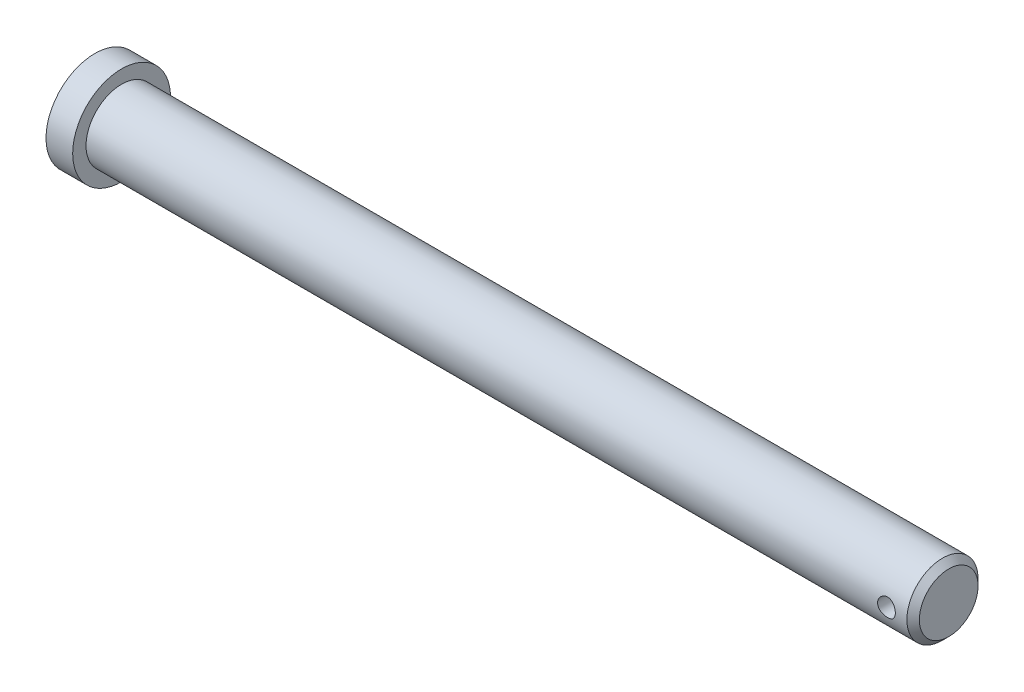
ISO-10303-21;
HEADER;
FILE_DESCRIPTION(('STEP AP214'),'2;1');
FILE_NAME('part.step','',(''),(''),'','','');
FILE_SCHEMA(('AUTOMOTIVE_DESIGN { 1 0 10303 214 1 1 1 1 }'));
ENDSEC;
DATA;
#1=APPLICATION_CONTEXT('core data for automotive mechanical design processes');
#2=APPLICATION_PROTOCOL_DEFINITION('international standard','automotive_design',2000,#1);
#3=PRODUCT_CONTEXT('',#1,'mechanical');
#4=PRODUCT('Part','Part','',(#3));
#5=PRODUCT_RELATED_PRODUCT_CATEGORY('part','',(#4));
#6=PRODUCT_DEFINITION_FORMATION('','',#4);
#7=PRODUCT_DEFINITION_CONTEXT('part definition',#1,'design');
#8=PRODUCT_DEFINITION('design','',#6,#7);
#9=PRODUCT_DEFINITION_SHAPE('','',#8);
#10=(LENGTH_UNIT() NAMED_UNIT(*) SI_UNIT(.MILLI.,.METRE.));
#11=(NAMED_UNIT(*) PLANE_ANGLE_UNIT() SI_UNIT($,.RADIAN.));
#12=(NAMED_UNIT(*) SI_UNIT($,.STERADIAN.) SOLID_ANGLE_UNIT());
#13=UNCERTAINTY_MEASURE_WITH_UNIT(LENGTH_MEASURE(1.E-05),#10,'distance_accuracy_value','');
#14=(GEOMETRIC_REPRESENTATION_CONTEXT(3) GLOBAL_UNCERTAINTY_ASSIGNED_CONTEXT((#13)) GLOBAL_UNIT_ASSIGNED_CONTEXT((#10,
#11,#12)) REPRESENTATION_CONTEXT('',''));
#15=CARTESIAN_POINT('',(0.,0.,0.));
#16=DIRECTION('',(0.,0.,1.));
#17=DIRECTION('',(1.,0.,0.));
#18=AXIS2_PLACEMENT_3D('',#15,#16,#17);
#19=CARTESIAN_POINT('',(0.,0.,0.));
#20=DIRECTION('',(-1.,0.,0.));
#21=DIRECTION('',(0.,0.,0.999999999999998));
#22=AXIS2_PLACEMENT_3D('',#19,#20,#21);
#23=PLANE('',#22);
#24=CARTESIAN_POINT('',(0.,0.,0.));
#25=DIRECTION('',(-1.,0.,0.));
#26=DIRECTION('',(0.,0.,0.999999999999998));
#27=AXIS2_PLACEMENT_3D('',#24,#25,#26);
#28=CIRCLE('',#27,3.30000000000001);
#29=CARTESIAN_POINT('',(0.,0.,3.3));
#30=VERTEX_POINT('',#29);
#31=EDGE_CURVE('E10',#30,#30,#28,.F.);
#32=ORIENTED_EDGE('',*,*,#31,.T.);
#33=EDGE_LOOP('',(#32));
#34=FACE_BOUND('',#33,.T.);
#35=ADVANCED_FACE('F34',(#34),#23,.F.);
#36=CARTESIAN_POINT('',(-96.0000000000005,1.11022302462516E-12,-8.88178419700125E-13));
#37=DIRECTION('',(-1.,0.,0.));
#38=DIRECTION('',(0.,0.,0.999999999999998));
#39=AXIS2_PLACEMENT_3D('',#36,#37,#38);
#40=CYLINDRICAL_SURFACE('',#39,3.99999999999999);
#41=CARTESIAN_POINT('',(-0.699999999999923,1.33226762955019E-12,-2.22044604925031E-12));
#42=DIRECTION('',(-1.,0.,0.));
#43=DIRECTION('',(0.,0.,0.999999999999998));
#44=AXIS2_PLACEMENT_3D('',#41,#42,#43);
#45=CIRCLE('',#44,3.99999999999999);
#46=CARTESIAN_POINT('',(-0.699999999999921,1.35658151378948E-12,3.99999999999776));
#47=VERTEX_POINT('',#46);
#48=EDGE_CURVE('E41',#47,#47,#45,.T.);
#49=ORIENTED_EDGE('',*,*,#48,.T.);
#50=EDGE_LOOP('',(#49));
#51=FACE_BOUND('',#50,.T.);
#52=CARTESIAN_POINT('',(-1.99999999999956,2.22044604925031E-12,3.99999999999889));
#53=CARTESIAN_POINT('',(-2.00000155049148,-0.0552507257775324,3.99999906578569));
#54=CARTESIAN_POINT('',(-2.00459436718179,-0.110518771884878,3.99884385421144));
#55=CARTESIAN_POINT('',(-2.02281676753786,-0.219470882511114,3.99434742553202));
#56=CARTESIAN_POINT('',(-2.0364514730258,-0.273154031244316,3.99100496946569));
#57=CARTESIAN_POINT('',(-2.07229283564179,-0.377347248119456,3.98250417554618));
#58=CARTESIAN_POINT('',(-2.09448919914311,-0.427861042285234,3.97734801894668));
#59=CARTESIAN_POINT('',(-2.14678759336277,-0.524448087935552,3.96576895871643));
#60=CARTESIAN_POINT('',(-2.17688989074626,-0.570521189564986,3.95934601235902));
#61=CARTESIAN_POINT('',(-2.24480052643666,-0.657867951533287,3.94578275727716));
#62=CARTESIAN_POINT('',(-2.28274104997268,-0.69903712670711,3.93863138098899));
#63=CARTESIAN_POINT('',(-2.36496813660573,-0.774499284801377,3.92449080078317));
#64=CARTESIAN_POINT('',(-2.40925541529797,-0.808791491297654,3.91750161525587));
#65=CARTESIAN_POINT('',(-2.50373015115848,-0.870017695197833,3.90436517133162));
#66=CARTESIAN_POINT('',(-2.55399548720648,-0.896834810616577,3.89823196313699));
#67=CARTESIAN_POINT('',(-2.65849894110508,-0.9415979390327,3.88766329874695));
#68=CARTESIAN_POINT('',(-2.71273642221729,-0.959545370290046,3.88322757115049));
#69=CARTESIAN_POINT('',(-2.82249566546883,-0.985703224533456,3.87666984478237));
#70=CARTESIAN_POINT('',(-2.87796993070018,-0.994101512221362,3.87450327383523));
#71=CARTESIAN_POINT('',(-2.98957904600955,-1.00150785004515,3.87259575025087));
#72=CARTESIAN_POINT('',(-3.04571378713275,-1.00051742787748,3.87285440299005));
#73=CARTESIAN_POINT('',(-3.1556105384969,-0.98932434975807,3.87572803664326));
#74=CARTESIAN_POINT('',(-3.20939708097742,-0.979345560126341,3.8782857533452));
#75=CARTESIAN_POINT('',(-3.31450736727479,-0.950816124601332,3.885378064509));
#76=CARTESIAN_POINT('',(-3.36583093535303,-0.932264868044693,3.88991279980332));
#77=CARTESIAN_POINT('',(-3.4651586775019,-0.886926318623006,3.90050075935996));
#78=CARTESIAN_POINT('',(-3.51312411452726,-0.860057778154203,3.90656884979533));
#79=CARTESIAN_POINT('',(-3.60394580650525,-0.798904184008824,3.91953140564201));
#80=CARTESIAN_POINT('',(-3.64680116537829,-0.764617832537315,3.92642601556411));
#81=CARTESIAN_POINT('',(-3.72746907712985,-0.688442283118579,3.94050587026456));
#82=CARTESIAN_POINT('',(-3.76510299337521,-0.6463641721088,3.94769379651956));
#83=CARTESIAN_POINT('',(-3.83281416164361,-0.556407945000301,3.96137310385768));
#84=CARTESIAN_POINT('',(-3.86289118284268,-0.508529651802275,3.96786446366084));
#85=CARTESIAN_POINT('',(-3.91470039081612,-0.408077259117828,3.97945154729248));
#86=CARTESIAN_POINT('',(-3.93640356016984,-0.355487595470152,3.98454240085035));
#87=CARTESIAN_POINT('',(-3.97061153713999,-0.247250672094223,3.99271944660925));
#88=CARTESIAN_POINT('',(-3.98311810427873,-0.191603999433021,3.99580602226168));
#89=CARTESIAN_POINT('',(-3.99830504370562,-0.0803599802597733,3.99956999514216));
#90=CARTESIAN_POINT('',(-4.00122868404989,-0.0247978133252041,4.00030702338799));
#91=CARTESIAN_POINT('',(-3.99783399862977,0.086021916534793,3.99945869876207));
#92=CARTESIAN_POINT('',(-3.9915165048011,0.141279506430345,3.99787355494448));
#93=CARTESIAN_POINT('',(-3.97001939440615,0.249076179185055,3.99259720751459));
#94=CARTESIAN_POINT('',(-3.95497249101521,0.301643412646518,3.98893756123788));
#95=CARTESIAN_POINT('',(-3.91659527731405,0.403504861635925,3.97992471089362));
#96=CARTESIAN_POINT('',(-3.89326413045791,0.452798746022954,3.97457133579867));
#97=CARTESIAN_POINT('',(-3.83850924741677,0.547682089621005,3.96262205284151));
#98=CARTESIAN_POINT('',(-3.80694925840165,0.593190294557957,3.95600578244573));
#99=CARTESIAN_POINT('',(-3.73680672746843,0.678351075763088,3.94229672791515));
#100=CARTESIAN_POINT('',(-3.69822297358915,0.718002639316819,3.93520386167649));
#101=CARTESIAN_POINT('',(-3.61399869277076,0.791327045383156,3.92112637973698));
#102=CARTESIAN_POINT('',(-3.56820819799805,0.824829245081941,3.91414869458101));
#103=CARTESIAN_POINT('',(-3.47151157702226,0.883673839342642,3.90128585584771));
#104=CARTESIAN_POINT('',(-3.42060567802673,0.909016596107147,3.8954006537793));
#105=CARTESIAN_POINT('',(-3.31539618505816,0.950634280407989,3.88545396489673));
#106=CARTESIAN_POINT('',(-3.2611149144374,0.966962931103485,3.88138170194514));
#107=CARTESIAN_POINT('',(-3.15046024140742,0.990230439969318,3.87551162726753));
#108=CARTESIAN_POINT('',(-3.09408729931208,0.997171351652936,3.87371331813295));
#109=CARTESIAN_POINT('',(-2.98258598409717,1.00135906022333,3.87263267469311));
#110=CARTESIAN_POINT('',(-2.92746837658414,0.998878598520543,3.87327955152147));
#111=CARTESIAN_POINT('',(-2.8184640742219,0.98491818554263,3.8768527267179));
#112=CARTESIAN_POINT('',(-2.76457735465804,0.973438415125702,3.87977897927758));
#113=CARTESIAN_POINT('',(-2.65986102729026,0.941954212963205,3.88754173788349));
#114=CARTESIAN_POINT('',(-2.60901512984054,0.922000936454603,3.89236676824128));
#115=CARTESIAN_POINT('',(-2.51135641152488,0.874176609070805,3.90338503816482));
#116=CARTESIAN_POINT('',(-2.46454415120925,0.846304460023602,3.90957846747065));
#117=CARTESIAN_POINT('',(-2.37496358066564,0.782578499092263,3.92283756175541));
#118=CARTESIAN_POINT('',(-2.33233261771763,0.746535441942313,3.92992176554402));
#119=CARTESIAN_POINT('',(-2.25363530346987,0.667859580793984,3.94405351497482));
#120=CARTESIAN_POINT('',(-2.2175705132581,0.625225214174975,3.9511010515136));
#121=CARTESIAN_POINT('',(-2.15239246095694,0.533645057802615,3.96451770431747));
#122=CARTESIAN_POINT('',(-2.12341692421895,0.484598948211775,3.97087222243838));
#123=CARTESIAN_POINT('',(-2.07416835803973,0.382177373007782,3.98203283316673));
#124=CARTESIAN_POINT('',(-2.05388909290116,0.328805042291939,3.98684003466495));
#125=CARTESIAN_POINT('',(-2.02561877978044,0.229606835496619,3.9936537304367));
#126=CARTESIAN_POINT('',(-2.01603250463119,0.184253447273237,3.99601723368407));
#127=CARTESIAN_POINT('',(-2.00322270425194,0.0926040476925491,3.99919070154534));
#128=CARTESIAN_POINT('',(-1.99999870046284,0.046308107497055,4.00000078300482));
#129=CARTESIAN_POINT('',(-1.99999999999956,2.22044604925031E-12,3.99999999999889));
#130=B_SPLINE_CURVE_WITH_KNOTS('',3,(#52,#53,#54,#55,#56,#57,#58,#59,#60,#61,#62,#63,#64,#65,
#66,#67,#68,#69,#70,#71,#72,#73,#74,#75,#76,#77,#78,#79,#80,#81,#82,#83,#84,#85,#86,#87,#88,#89,
#90,#91,#92,#93,#94,#95,#96,#97,#98,#99,#100,#101,#102,#103,#104,#105,#106,#107,#108,#109,#110,
#111,#112,#113,#114,#115,#116,#117,#118,#119,#120,#121,#122,#123,#124,#125,#126,#127,#128,#129),
.UNSPECIFIED.,.T.,.F.,(4,2,2,2,2,2,2,2,2,2,2,2,2,2,2,2,2,2,2,2,2,2,2,2,2,2,2,2,2,2,2,2,2,2,2,2,
2,2,4),(0.,0.165582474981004,0.331258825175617,0.49673660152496,0.662219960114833,
0.830762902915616,0.999324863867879,1.17039098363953,1.34142974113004,1.50904196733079,
1.67662692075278,1.84014998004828,2.00368468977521,2.16887018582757,2.33408460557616,
2.50401000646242,2.67394059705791,2.84445486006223,3.01493649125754,3.1810553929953,
3.347159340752,3.51080183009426,3.67446084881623,3.84102391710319,4.00761575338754,
4.17829672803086,4.34897012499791,4.5186150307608,4.68822282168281,4.85295853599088,
5.01769093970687,5.18144267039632,5.34521712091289,5.51326384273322,5.68135046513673,
5.85248123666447,6.02348909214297,6.16228161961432,6.30106370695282),.UNSPECIFIED.);
#131=CARTESIAN_POINT('',(-1.99999999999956,2.22044604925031E-12,3.99999999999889));
#132=VERTEX_POINT('',#131);
#133=EDGE_CURVE('E52',#132,#132,#130,.T.);
#134=ORIENTED_EDGE('',*,*,#133,.T.);
#135=EDGE_LOOP('',(#134));
#136=FACE_BOUND('',#135,.T.);
#137=CARTESIAN_POINT('',(-2.00000000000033,1.11022302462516E-12,-4.00000000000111));
#138=CARTESIAN_POINT('',(-2.00000155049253,0.0552507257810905,-3.99999906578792));
#139=CARTESIAN_POINT('',(-2.00459436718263,0.110518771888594,-3.99884385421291));
#140=CARTESIAN_POINT('',(-2.02281676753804,0.21947088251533,-3.99434742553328));
#141=CARTESIAN_POINT('',(-2.03645147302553,0.273154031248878,-3.9910049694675));
#142=CARTESIAN_POINT('',(-2.07229283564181,0.377347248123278,-3.98250417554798));
#143=CARTESIAN_POINT('',(-2.09448919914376,0.427861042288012,-3.97734801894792));
#144=CARTESIAN_POINT('',(-2.14678759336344,0.524448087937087,-3.96576895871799));
#145=CARTESIAN_POINT('',(-2.17688989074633,0.570521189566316,-3.95934601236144));
#146=CARTESIAN_POINT('',(-2.24480052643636,0.657867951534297,-3.94578275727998));
#147=CARTESIAN_POINT('',(-2.2827410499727,0.699037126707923,-3.93863138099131));
#148=CARTESIAN_POINT('',(-2.36496813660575,0.774499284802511,-3.92449080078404));
#149=CARTESIAN_POINT('',(-2.40925541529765,0.808791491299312,-3.91750161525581));
#150=CARTESIAN_POINT('',(-2.50373015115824,0.870017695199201,-3.9043651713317));
#151=CARTESIAN_POINT('',(-2.55399548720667,0.896834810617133,-3.89823196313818));
#152=CARTESIAN_POINT('',(-2.65849894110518,0.941597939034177,-3.88766329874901));
#153=CARTESIAN_POINT('',(-2.71273642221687,0.959545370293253,-3.88322757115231));
#154=CARTESIAN_POINT('',(-2.82249566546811,0.98570322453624,-3.8766698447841));
#155=CARTESIAN_POINT('',(-2.87796993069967,0.994101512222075,-3.87450327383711));
#156=CARTESIAN_POINT('',(-2.98957904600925,1.00150785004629,-3.87259575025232));
#157=CARTESIAN_POINT('',(-3.04571378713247,1.00051742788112,-3.87285440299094));
#158=CARTESIAN_POINT('',(-3.15561053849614,0.989324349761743,-3.87572803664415));
#159=CARTESIAN_POINT('',(-3.2093970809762,0.979345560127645,-3.87828575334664));
#160=CARTESIAN_POINT('',(-3.31450736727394,0.950816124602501,-3.88537806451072));
#161=CARTESIAN_POINT('',(-3.36583093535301,0.932264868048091,-3.88991279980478));
#162=CARTESIAN_POINT('',(-3.46515867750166,0.886926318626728,-3.90050075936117));
#163=CARTESIAN_POINT('',(-3.51312411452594,0.860057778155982,-3.90656884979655));
#164=CARTESIAN_POINT('',(-3.60394580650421,0.798904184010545,-3.9195314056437));
#165=CARTESIAN_POINT('',(-3.6468011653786,0.764617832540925,-3.92642601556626));
#166=CARTESIAN_POINT('',(-3.72746907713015,0.688442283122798,-3.94050587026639));
#167=CARTESIAN_POINT('',(-3.76510299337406,0.646364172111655,-3.94769379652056));
#168=CARTESIAN_POINT('',(-3.83281416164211,0.556407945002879,-3.9613731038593));
#169=CARTESIAN_POINT('',(-3.86289118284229,0.508529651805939,-3.9678644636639));
#170=CARTESIAN_POINT('',(-3.91470039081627,0.40807725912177,-3.97945154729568));
#171=CARTESIAN_POINT('',(-3.93640356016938,0.355487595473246,-3.98454240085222));
#172=CARTESIAN_POINT('',(-3.97061153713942,0.247250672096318,-3.99271944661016));
#173=CARTESIAN_POINT('',(-3.98311810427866,0.191603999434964,-3.99580602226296));
#174=CARTESIAN_POINT('',(-3.99830504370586,0.080359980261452,-3.99956999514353));
#175=CARTESIAN_POINT('',(-4.00122868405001,0.0247978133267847,-4.00030702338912));
#176=CARTESIAN_POINT('',(-3.99783399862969,-0.0860219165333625,-3.99945869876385));
#177=CARTESIAN_POINT('',(-3.99151650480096,-0.141279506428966,-3.99787355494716));
#178=CARTESIAN_POINT('',(-3.97001939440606,-0.249076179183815,-3.99259720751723));
#179=CARTESIAN_POINT('',(-3.95497249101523,-0.301643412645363,-3.98893756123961));
#180=CARTESIAN_POINT('',(-3.91659527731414,-0.403504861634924,-3.9799247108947));
#181=CARTESIAN_POINT('',(-3.89326413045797,-0.452798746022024,-3.97457133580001));
#182=CARTESIAN_POINT('',(-3.83850924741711,-0.547682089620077,-3.96262205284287));
#183=CARTESIAN_POINT('',(-3.80694925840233,-0.593190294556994,-3.95600578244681));
#184=CARTESIAN_POINT('',(-3.73680672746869,-0.678351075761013,-3.94229672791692));
#185=CARTESIAN_POINT('',(-3.69822297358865,-0.718002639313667,-3.93520386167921));
#186=CARTESIAN_POINT('',(-3.61399869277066,-0.791327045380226,-3.92112637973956));
#187=CARTESIAN_POINT('',(-3.56820819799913,-0.824829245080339,-3.91414869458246));
#188=CARTESIAN_POINT('',(-3.47151157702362,-0.883673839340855,-3.90128585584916));
#189=CARTESIAN_POINT('',(-3.42060567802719,-0.909016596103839,-3.89540065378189));
#190=CARTESIAN_POINT('',(-3.31539618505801,-0.950634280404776,-3.88545396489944));
#191=CARTESIAN_POINT('',(-3.2611149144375,-0.966962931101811,-3.88138170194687));
#192=CARTESIAN_POINT('',(-3.15046024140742,-0.990230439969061,-3.87551162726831));
#193=CARTESIAN_POINT('',(-3.09408729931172,-0.99717135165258,-3.87371331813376));
#194=CARTESIAN_POINT('',(-2.98258598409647,-1.00135906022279,-3.87263267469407));
#195=CARTESIAN_POINT('',(-2.92746837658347,-0.998878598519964,-3.87327955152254));
#196=CARTESIAN_POINT('',(-2.81846407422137,-0.984918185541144,-3.87685272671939));
#197=CARTESIAN_POINT('',(-2.76457735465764,-0.973438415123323,-3.87977897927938));
#198=CARTESIAN_POINT('',(-2.65986102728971,-0.941954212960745,-3.88754173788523));
#199=CARTESIAN_POINT('',(-2.60901512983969,-0.92200093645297,-3.89236676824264));
#200=CARTESIAN_POINT('',(-2.51135641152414,-0.874176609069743,-3.90338503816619));
#201=CARTESIAN_POINT('',(-2.46454415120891,-0.846304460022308,-3.90957846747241));
#202=CARTESIAN_POINT('',(-2.37496358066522,-0.782578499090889,-3.92283756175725));
#203=CARTESIAN_POINT('',(-2.33233261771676,-0.746535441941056,-3.92992176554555));
#204=CARTESIAN_POINT('',(-2.25363530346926,-0.667859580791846,-3.94405351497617));
#205=CARTESIAN_POINT('',(-2.21757051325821,-0.625225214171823,-3.95110105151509));
#206=CARTESIAN_POINT('',(-2.15239246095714,-0.533645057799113,-3.96451770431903));
#207=CARTESIAN_POINT('',(-2.12341692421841,-0.484598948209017,-3.97087222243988));
#208=CARTESIAN_POINT('',(-2.07416835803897,-0.382177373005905,-3.98203283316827));
#209=CARTESIAN_POINT('',(-2.05388909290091,-0.32880504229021,-3.98684003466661));
#210=CARTESIAN_POINT('',(-2.02561877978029,-0.229606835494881,-3.99365373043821));
#211=CARTESIAN_POINT('',(-2.01603250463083,-0.184253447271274,-3.99601723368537));
#212=CARTESIAN_POINT('',(-2.00322270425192,-0.0926040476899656,-3.99919070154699));
#213=CARTESIAN_POINT('',(-1.99999870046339,-0.0463081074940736,-4.00000078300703));
#214=CARTESIAN_POINT('',(-2.00000000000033,1.11022302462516E-12,-4.00000000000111));
#215=B_SPLINE_CURVE_WITH_KNOTS('',3,(#137,#138,#139,#140,#141,#142,#143,#144,#145,#146,#147,
#148,#149,#150,#151,#152,#153,#154,#155,#156,#157,#158,#159,#160,#161,#162,#163,#164,#165,#166,
#167,#168,#169,#170,#171,#172,#173,#174,#175,#176,#177,#178,#179,#180,#181,#182,#183,#184,#185,
#186,#187,#188,#189,#190,#191,#192,#193,#194,#195,#196,#197,#198,#199,#200,#201,#202,#203,#204,
#205,#206,#207,#208,#209,#210,#211,#212,#213,#214),.UNSPECIFIED.,.T.,.F.,(4,2,2,2,2,2,2,2,2,2,2,
2,2,2,2,2,2,2,2,2,2,2,2,2,2,2,2,2,2,2,2,2,2,2,2,2,2,2,4),(0.,0.165582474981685,
0.331258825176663,0.496736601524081,0.662219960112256,0.830762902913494,0.999324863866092,
1.17039098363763,1.3414297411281,1.50904196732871,1.67662692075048,1.84014998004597,
2.00368468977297,2.16887018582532,2.3340846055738,2.50401000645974,2.67394059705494,
2.84445486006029,3.01493649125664,3.18105539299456,3.34715934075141,3.51080183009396,
3.67446084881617,3.84102391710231,4.00761575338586,4.17829672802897,4.34897012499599,
4.51861503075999,4.68822282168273,4.85295853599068,5.01769093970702,5.18144267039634,
5.34521712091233,5.51326384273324,5.68135046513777,5.85248123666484,6.02348909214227,
6.1622816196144,6.30106370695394),.UNSPECIFIED.);
#216=CARTESIAN_POINT('',(-2.00000000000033,1.11022302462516E-12,-4.00000000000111));
#217=VERTEX_POINT('',#216);
#218=EDGE_CURVE('E60',#217,#217,#215,.T.);
#219=ORIENTED_EDGE('',*,*,#218,.T.);
#220=EDGE_LOOP('',(#219));
#221=FACE_BOUND('',#220,.T.);
#222=CARTESIAN_POINT('',(-93.0000000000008,2.1094237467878E-12,-1.11022302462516E-12));
#223=DIRECTION('',(-1.,0.,0.));
#224=DIRECTION('',(0.,0.,0.999999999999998));
#225=AXIS2_PLACEMENT_3D('',#222,#223,#224);
#226=CIRCLE('',#225,3.99999999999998);
#227=CARTESIAN_POINT('',(-93.0000000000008,2.13373763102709E-12,3.99999999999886));
#228=VERTEX_POINT('',#227);
#229=EDGE_CURVE('E45',#228,#228,#226,.T.);
#230=ORIENTED_EDGE('',*,*,#229,.F.);
#231=EDGE_LOOP('',(#230));
#232=FACE_BOUND('',#231,.T.);
#233=ADVANCED_FACE('F63',(#51,#136,#221,#232),#40,.T.);
#234=CARTESIAN_POINT('',(-93.,4.00000000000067,-1.11022302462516E-12));
#235=DIRECTION('',(-1.,0.,0.));
#236=DIRECTION('',(0.,0.,0.999999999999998));
#237=AXIS2_PLACEMENT_3D('',#234,#235,#236);
#238=PLANE('',#237);
#239=CARTESIAN_POINT('',(-93.0000000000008,2.1094237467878E-12,-1.11022302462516E-12));
#240=DIRECTION('',(-1.,0.,0.));
#241=DIRECTION('',(0.,0.,0.999999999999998));
#242=AXIS2_PLACEMENT_3D('',#239,#240,#241);
#243=CIRCLE('',#242,5.5);
#244=CARTESIAN_POINT('',(-93.0000000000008,2.14285533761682E-12,5.49999999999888));
#245=VERTEX_POINT('',#244);
#246=EDGE_CURVE('E49',#245,#245,#243,.T.);
#247=ORIENTED_EDGE('',*,*,#246,.F.);
#248=EDGE_LOOP('',(#247));
#249=FACE_BOUND('',#248,.T.);
#250=ORIENTED_EDGE('',*,*,#229,.T.);
#251=EDGE_LOOP('',(#250));
#252=FACE_BOUND('',#251,.T.);
#253=ADVANCED_FACE('F78',(#249,#252),#238,.F.);
#254=CARTESIAN_POINT('',(-96.0000000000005,1.11022302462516E-12,-8.88178419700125E-13));
#255=DIRECTION('',(-1.,0.,0.));
#256=DIRECTION('',(0.,0.,0.999999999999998));
#257=AXIS2_PLACEMENT_3D('',#254,#255,#256);
#258=CYLINDRICAL_SURFACE('',#257,5.5);
#259=CARTESIAN_POINT('',(-96.0000000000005,1.11022302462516E-12,-8.88178419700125E-13));
#260=DIRECTION('',(-1.,0.,0.));
#261=DIRECTION('',(0.,0.,0.999999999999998));
#262=AXIS2_PLACEMENT_3D('',#259,#260,#261);
#263=CIRCLE('',#262,5.5);
#264=CARTESIAN_POINT('',(-96.0000000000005,1.14365461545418E-12,5.4999999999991));
#265=VERTEX_POINT('',#264);
#266=EDGE_CURVE('E59',#265,#265,#263,.T.);
#267=ORIENTED_EDGE('',*,*,#266,.F.);
#268=EDGE_LOOP('',(#267));
#269=FACE_BOUND('',#268,.T.);
#270=ORIENTED_EDGE('',*,*,#246,.T.);
#271=EDGE_LOOP('',(#270));
#272=FACE_BOUND('',#271,.T.);
#273=ADVANCED_FACE('F75',(#269,#272),#258,.T.);
#274=CARTESIAN_POINT('',(-96.0000000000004,5.50000000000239,-6.66133814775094E-13));
#275=DIRECTION('',(1.,0.,0.));
#276=DIRECTION('',(0.,0.,-0.999999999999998));
#277=AXIS2_PLACEMENT_3D('',#274,#275,#276);
#278=PLANE('',#277);
#279=ORIENTED_EDGE('',*,*,#266,.T.);
#280=EDGE_LOOP('',(#279));
#281=FACE_BOUND('',#280,.T.);
#282=ADVANCED_FACE('F70',(#281),#278,.F.);
#283=CARTESIAN_POINT('',(-2.99999999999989,4.44089209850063E-13,-5.50000000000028));
#284=DIRECTION('',(0.,0.,0.999999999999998));
#285=DIRECTION('',(1.,0.,0.));
#286=AXIS2_PLACEMENT_3D('',#283,#284,#285);
#287=CYLINDRICAL_SURFACE('',#286,1.);
#288=ORIENTED_EDGE('',*,*,#218,.F.);
#289=EDGE_LOOP('',(#288));
#290=FACE_BOUND('',#289,.T.);
#291=ORIENTED_EDGE('',*,*,#133,.F.);
#292=EDGE_LOOP('',(#291));
#293=FACE_BOUND('',#292,.T.);
#294=ADVANCED_FACE('F66',(#290,#293),#287,.F.);
#295=CARTESIAN_POINT('',(-0.699999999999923,1.33226762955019E-12,-2.22044604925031E-12));
#296=DIRECTION('',(-1.,0.,0.));
#297=DIRECTION('',(0.,0.,0.999999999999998));
#298=AXIS2_PLACEMENT_3D('',#295,#296,#297);
#299=CONICAL_SURFACE('',#298,3.99999999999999,0.78539816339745);
#300=ORIENTED_EDGE('',*,*,#31,.F.);
#301=EDGE_LOOP('',(#300));
#302=FACE_BOUND('',#301,.T.);
#303=ORIENTED_EDGE('',*,*,#48,.F.);
#304=EDGE_LOOP('',(#303));
#305=FACE_BOUND('',#304,.T.);
#306=ADVANCED_FACE('F36',(#302,#305),#299,.T.);
#307=CLOSED_SHELL('',(#35,#233,#253,#273,#282,#294,#306));
#308=MANIFOLD_SOLID_BREP('B2',#307);
#309=ADVANCED_BREP_SHAPE_REPRESENTATION('',(#18,#308),#14);
#310=SHAPE_DEFINITION_REPRESENTATION(#9,#309);
ENDSEC;
END-ISO-10303-21;
